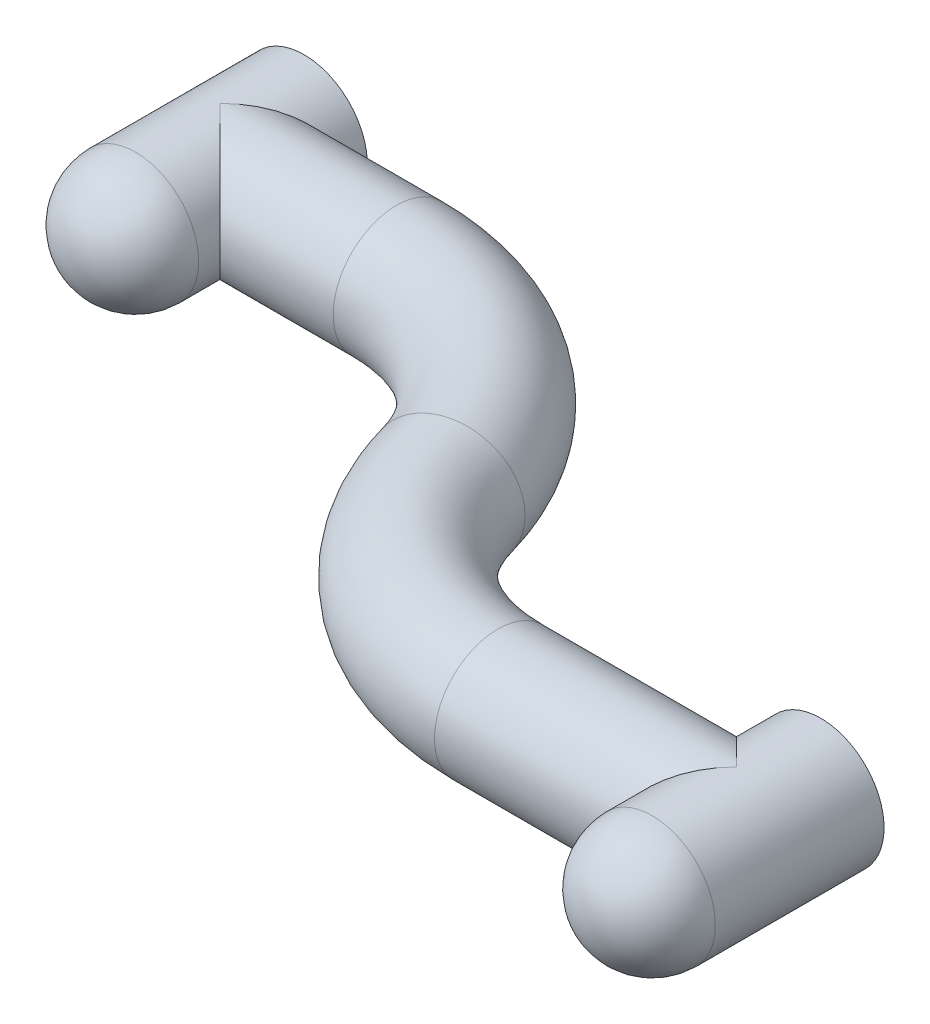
ISO-10303-21;
HEADER;
FILE_DESCRIPTION(('STEP AP214'),'2;1');
FILE_NAME('part.step','',(''),(''),'','','');
FILE_SCHEMA(('AUTOMOTIVE_DESIGN { 1 0 10303 214 1 1 1 1 }'));
ENDSEC;
DATA;
#1=APPLICATION_CONTEXT('core data for automotive mechanical design processes');
#2=APPLICATION_PROTOCOL_DEFINITION('international standard','automotive_design',2000,#1);
#3=PRODUCT_CONTEXT('',#1,'mechanical');
#4=PRODUCT('Part','Part','',(#3));
#5=PRODUCT_RELATED_PRODUCT_CATEGORY('part','',(#4));
#6=PRODUCT_DEFINITION_FORMATION('','',#4);
#7=PRODUCT_DEFINITION_CONTEXT('part definition',#1,'design');
#8=PRODUCT_DEFINITION('design','',#6,#7);
#9=PRODUCT_DEFINITION_SHAPE('','',#8);
#10=(LENGTH_UNIT() NAMED_UNIT(*) SI_UNIT(.MILLI.,.METRE.));
#11=(NAMED_UNIT(*) PLANE_ANGLE_UNIT() SI_UNIT($,.RADIAN.));
#12=(NAMED_UNIT(*) SI_UNIT($,.STERADIAN.) SOLID_ANGLE_UNIT());
#13=UNCERTAINTY_MEASURE_WITH_UNIT(LENGTH_MEASURE(1.E-05),#10,'distance_accuracy_value','');
#14=(GEOMETRIC_REPRESENTATION_CONTEXT(3) GLOBAL_UNCERTAINTY_ASSIGNED_CONTEXT((#13)) GLOBAL_UNIT_ASSIGNED_CONTEXT((#10,
#11,#12)) REPRESENTATION_CONTEXT('',''));
#15=CARTESIAN_POINT('',(0.,0.,0.));
#16=DIRECTION('',(0.,0.,1.));
#17=DIRECTION('',(1.,0.,0.));
#18=AXIS2_PLACEMENT_3D('',#15,#16,#17);
#19=CARTESIAN_POINT('',(-113.203482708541,-4.44089209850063E-13,0.));
#20=DIRECTION('',(1.,0.,0.));
#21=DIRECTION('',(0.,0.,-0.999999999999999));
#22=AXIS2_PLACEMENT_3D('',#19,#20,#21);
#23=CYLINDRICAL_SURFACE('',#22,30.);
#24=CARTESIAN_POINT('',(-113.203482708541,-4.44089209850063E-13,0.));
#25=DIRECTION('',(1.,0.,0.));
#26=DIRECTION('',(0.,0.,-0.999999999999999));
#27=AXIS2_PLACEMENT_3D('',#24,#25,#26);
#28=CIRCLE('',#27,30.);
#29=CARTESIAN_POINT('',(-113.203482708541,-4.44089209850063E-13,-30.));
#30=VERTEX_POINT('',#29);
#31=EDGE_CURVE('E106',#30,#30,#28,.T.);
#32=ORIENTED_EDGE('',*,*,#31,.T.);
#33=EDGE_LOOP('',(#32));
#34=FACE_BOUND('',#33,.T.);
#35=CARTESIAN_POINT('',(0.,0.,0.));
#36=DIRECTION('',(0.707106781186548,0.,0.707106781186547));
#37=DIRECTION('',(0.707106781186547,0.,-0.707106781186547));
#38=AXIS2_PLACEMENT_3D('',#35,#36,#37);
#39=ELLIPSE('',#38,42.4264068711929,30.);
#40=CARTESIAN_POINT('',(1.66533453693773E-13,-30.0000000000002,0.));
#41=VERTEX_POINT('',#40);
#42=CARTESIAN_POINT('',(2.22044604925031E-13,30.0000000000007,0.));
#43=VERTEX_POINT('',#42);
#44=EDGE_CURVE('E72',#41,#43,#39,.F.);
#45=ORIENTED_EDGE('',*,*,#44,.T.);
#46=CARTESIAN_POINT('',(0.,0.,0.));
#47=DIRECTION('',(0.707106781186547,0.,-0.707106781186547));
#48=DIRECTION('',(0.707106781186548,0.,0.707106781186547));
#49=AXIS2_PLACEMENT_3D('',#46,#47,#48);
#50=ELLIPSE('',#49,42.4264068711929,30.);
#51=EDGE_CURVE('E59',#43,#41,#50,.F.);
#52=ORIENTED_EDGE('',*,*,#51,.T.);
#53=EDGE_LOOP('',(#45,#52));
#54=FACE_BOUND('',#53,.T.);
#55=ADVANCED_FACE('F35',(#34,#54),#23,.T.);
#56=CARTESIAN_POINT('',(-311.22362176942,0.,-150.));
#57=DIRECTION('',(-1.,0.,0.));
#58=DIRECTION('',(0.,0.,0.999999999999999));
#59=AXIS2_PLACEMENT_3D('',#56,#57,#58);
#60=CYLINDRICAL_SURFACE('',#59,30.);
#61=CARTESIAN_POINT('',(-311.22362176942,0.,-150.));
#62=DIRECTION('',(1.,0.,0.));
#63=DIRECTION('',(0.,0.,-0.999999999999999));
#64=AXIS2_PLACEMENT_3D('',#61,#62,#63);
#65=CIRCLE('',#64,30.);
#66=CARTESIAN_POINT('',(-311.22362176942,0.,-180.));
#67=VERTEX_POINT('',#66);
#68=EDGE_CURVE('E39',#67,#67,#65,.T.);
#69=ORIENTED_EDGE('',*,*,#68,.F.);
#70=EDGE_LOOP('',(#69));
#71=FACE_BOUND('',#70,.T.);
#72=CARTESIAN_POINT('',(-395.,2.22044604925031E-13,-150.));
#73=DIRECTION('',(-0.707106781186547,0.,0.707106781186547));
#74=DIRECTION('',(-0.707106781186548,0.,-0.707106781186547));
#75=AXIS2_PLACEMENT_3D('',#72,#73,#74);
#76=ELLIPSE('',#75,42.4264068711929,30.);
#77=CARTESIAN_POINT('',(-395.,30.,-150.));
#78=VERTEX_POINT('',#77);
#79=CARTESIAN_POINT('',(-395.,-30.,-150.));
#80=VERTEX_POINT('',#79);
#81=EDGE_CURVE('E64',#78,#80,#76,.F.);
#82=ORIENTED_EDGE('',*,*,#81,.T.);
#83=CARTESIAN_POINT('',(-395.,2.22044604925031E-13,-150.));
#84=DIRECTION('',(-0.707106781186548,0.,-0.707106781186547));
#85=DIRECTION('',(-0.707106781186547,0.,0.707106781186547));
#86=AXIS2_PLACEMENT_3D('',#83,#84,#85);
#87=ELLIPSE('',#86,42.4264068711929,30.);
#88=EDGE_CURVE('E52',#80,#78,#87,.F.);
#89=ORIENTED_EDGE('',*,*,#88,.T.);
#90=EDGE_LOOP('',(#82,#89));
#91=FACE_BOUND('',#90,.T.);
#92=ADVANCED_FACE('F37',(#71,#91),#60,.T.);
#93=CARTESIAN_POINT('',(-311.22362176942,-2.22044604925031E-13,-47.1467075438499));
#94=DIRECTION('',(0.,1.,0.));
#95=DIRECTION('',(0.,0.,0.999999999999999));
#96=AXIS2_PLACEMENT_3D('',#93,#94,#95);
#97=TOROIDAL_SURFACE('',#96,102.85329245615,30.);
#98=CARTESIAN_POINT('',(-212.21355223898,2.22044604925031E-13,-74.9999999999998));
#99=DIRECTION('',(0.270806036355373,0.,0.962633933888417));
#100=DIRECTION('',(0.962633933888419,0.,-0.270806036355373));
#101=AXIS2_PLACEMENT_3D('',#98,#99,#100);
#102=CIRCLE('',#101,30.);
#103=CARTESIAN_POINT('',(-183.334534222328,3.51575473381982E-13,-83.124181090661));
#104=VERTEX_POINT('',#103);
#105=EDGE_CURVE('E309',#104,#104,#102,.T.);
#106=CARTESIAN_POINT('',(-311.22362176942,-2.22044604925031E-13,-47.1467075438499));
#107=DIRECTION('',(0.,1.,0.));
#108=DIRECTION('',(0.,0.,0.999999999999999));
#109=AXIS2_PLACEMENT_3D('',#106,#107,#108);
#110=CIRCLE('',#109,132.85329245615);
#111=EDGE_CURVE('',#104,#67,#110,.T.);
#112=ORIENTED_EDGE('',*,*,#105,.F.);
#113=ORIENTED_EDGE('',*,*,#68,.T.);
#114=ORIENTED_EDGE('',*,*,#111,.T.);
#115=ORIENTED_EDGE('',*,*,#111,.F.);
#116=EDGE_LOOP('',(#112,#114,#113,#115));
#117=FACE_BOUND('',#116,.T.);
#118=ADVANCED_FACE('F101',(#117),#97,.T.);
#119=CARTESIAN_POINT('',(-113.203482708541,-4.44089209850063E-13,-102.85329245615));
#120=DIRECTION('',(0.,-1.,0.));
#121=DIRECTION('',(0.,0.,-0.999999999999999));
#122=AXIS2_PLACEMENT_3D('',#119,#120,#121);
#123=TOROIDAL_SURFACE('',#122,102.85329245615,30.);
#124=ORIENTED_EDGE('',*,*,#31,.F.);
#125=EDGE_LOOP('',(#124));
#126=FACE_BOUND('',#125,.T.);
#127=ORIENTED_EDGE('',*,*,#105,.T.);
#128=EDGE_LOOP('',(#127));
#129=FACE_BOUND('',#128,.T.);
#130=ADVANCED_FACE('F281',(#126,#129),#123,.T.);
#131=CARTESIAN_POINT('',(0.,0.,-39.9999999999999));
#132=DIRECTION('',(0.,0.,0.999999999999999));
#133=DIRECTION('',(1.,0.,0.));
#134=AXIS2_PLACEMENT_3D('',#131,#132,#133);
#135=PLANE('',#134);
#136=CARTESIAN_POINT('',(0.,0.,-39.9999999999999));
#137=DIRECTION('',(0.,0.,0.999999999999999));
#138=DIRECTION('',(1.,0.,0.));
#139=AXIS2_PLACEMENT_3D('',#136,#137,#138);
#140=CIRCLE('',#139,27.);
#141=CARTESIAN_POINT('',(27.0000000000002,0.,-39.9999999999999));
#142=VERTEX_POINT('',#141);
#143=EDGE_CURVE('E127',#142,#142,#140,.T.);
#144=ORIENTED_EDGE('',*,*,#143,.T.);
#145=EDGE_LOOP('',(#144));
#146=FACE_BOUND('',#145,.T.);
#147=CARTESIAN_POINT('',(0.,0.,-39.9999999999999));
#148=DIRECTION('',(0.,0.,-0.999999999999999));
#149=DIRECTION('',(-1.,0.,0.));
#150=AXIS2_PLACEMENT_3D('',#147,#148,#149);
#151=CIRCLE('',#150,30.);
#152=CARTESIAN_POINT('',(-29.9999999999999,0.,-39.9999999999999));
#153=VERTEX_POINT('',#152);
#154=EDGE_CURVE('E69',#153,#153,#151,.T.);
#155=ORIENTED_EDGE('',*,*,#154,.T.);
#156=EDGE_LOOP('',(#155));
#157=FACE_BOUND('',#156,.T.);
#158=ADVANCED_FACE('F93',(#146,#157),#135,.F.);
#159=CARTESIAN_POINT('',(0.,0.,-39.9999999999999));
#160=DIRECTION('',(0.,0.,-0.999999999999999));
#161=DIRECTION('',(-1.,0.,0.));
#162=AXIS2_PLACEMENT_3D('',#159,#160,#161);
#163=CYLINDRICAL_SURFACE('',#162,30.);
#164=ORIENTED_EDGE('',*,*,#51,.F.);
#165=ORIENTED_EDGE('',*,*,#44,.F.);
#166=EDGE_LOOP('',(#164,#165));
#167=FACE_BOUND('',#166,.T.);
#168=ORIENTED_EDGE('',*,*,#154,.F.);
#169=EDGE_LOOP('',(#168));
#170=FACE_BOUND('',#169,.T.);
#171=CARTESIAN_POINT('',(0.,0.,39.9999999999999));
#172=DIRECTION('',(0.,0.,-0.999999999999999));
#173=DIRECTION('',(-1.,0.,0.));
#174=AXIS2_PLACEMENT_3D('',#171,#172,#173);
#175=CIRCLE('',#174,30.);
#176=CARTESIAN_POINT('',(-30.,0.,39.9999999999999));
#177=VERTEX_POINT('',#176);
#178=EDGE_CURVE('E112',#177,#177,#175,.T.);
#179=ORIENTED_EDGE('',*,*,#178,.T.);
#180=EDGE_LOOP('',(#179));
#181=FACE_BOUND('',#180,.T.);
#182=ADVANCED_FACE('F89',(#167,#170,#181),#163,.T.);
#183=CARTESIAN_POINT('',(-395.,-2.22044604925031E-13,-190.));
#184=DIRECTION('',(0.,0.,-0.999999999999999));
#185=DIRECTION('',(-1.,0.,0.));
#186=AXIS2_PLACEMENT_3D('',#183,#184,#185);
#187=CYLINDRICAL_SURFACE('',#186,30.);
#188=CARTESIAN_POINT('',(-395.,2.22044604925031E-13,-110.));
#189=DIRECTION('',(0.,0.,-0.999999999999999));
#190=DIRECTION('',(-1.,0.,0.));
#191=AXIS2_PLACEMENT_3D('',#188,#189,#190);
#192=CIRCLE('',#191,30.);
#193=CARTESIAN_POINT('',(-425.,2.228772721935E-13,-110.));
#194=VERTEX_POINT('',#193);
#195=EDGE_CURVE('E121',#194,#194,#192,.T.);
#196=ORIENTED_EDGE('',*,*,#195,.T.);
#197=EDGE_LOOP('',(#196));
#198=FACE_BOUND('',#197,.T.);
#199=CARTESIAN_POINT('',(-395.,-2.22044604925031E-13,-190.));
#200=DIRECTION('',(0.,0.,-0.999999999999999));
#201=DIRECTION('',(-1.,0.,0.));
#202=AXIS2_PLACEMENT_3D('',#199,#200,#201);
#203=CIRCLE('',#202,30.);
#204=CARTESIAN_POINT('',(-425.,-2.21211937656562E-13,-190.));
#205=VERTEX_POINT('',#204);
#206=EDGE_CURVE('E67',#205,#205,#203,.T.);
#207=ORIENTED_EDGE('',*,*,#206,.F.);
#208=EDGE_LOOP('',(#207));
#209=FACE_BOUND('',#208,.T.);
#210=ORIENTED_EDGE('',*,*,#88,.F.);
#211=ORIENTED_EDGE('',*,*,#81,.F.);
#212=EDGE_LOOP('',(#210,#211));
#213=FACE_BOUND('',#212,.T.);
#214=ADVANCED_FACE('F65',(#198,#209,#213),#187,.T.);
#215=CARTESIAN_POINT('',(-395.,-2.22044604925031E-13,-190.));
#216=DIRECTION('',(0.,0.,-0.999999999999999));
#217=DIRECTION('',(-1.,0.,0.));
#218=AXIS2_PLACEMENT_3D('',#215,#216,#217);
#219=PLANE('',#218);
#220=CARTESIAN_POINT('',(-395.,-2.22044604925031E-13,-190.));
#221=DIRECTION('',(0.,0.,0.999999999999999));
#222=DIRECTION('',(1.,0.,0.));
#223=AXIS2_PLACEMENT_3D('',#220,#221,#222);
#224=CIRCLE('',#223,27.);
#225=CARTESIAN_POINT('',(-368.,-2.22794005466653E-13,-190.));
#226=VERTEX_POINT('',#225);
#227=EDGE_CURVE('E118',#226,#226,#224,.T.);
#228=ORIENTED_EDGE('',*,*,#227,.T.);
#229=EDGE_LOOP('',(#228));
#230=FACE_BOUND('',#229,.T.);
#231=ORIENTED_EDGE('',*,*,#206,.T.);
#232=EDGE_LOOP('',(#231));
#233=FACE_BOUND('',#232,.T.);
#234=ADVANCED_FACE('F142',(#230,#233),#219,.T.);
#235=CARTESIAN_POINT('',(1.66533453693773E-13,0.,-190.));
#236=DIRECTION('',(0.,0.,0.999999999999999));
#237=DIRECTION('',(1.,0.,0.));
#238=AXIS2_PLACEMENT_3D('',#235,#236,#237);
#239=CYLINDRICAL_SURFACE('',#238,27.);
#240=CARTESIAN_POINT('',(0.,0.,39.9999999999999));
#241=DIRECTION('',(0.,0.,-0.999999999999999));
#242=DIRECTION('',(-1.,0.,0.));
#243=AXIS2_PLACEMENT_3D('',#240,#241,#242);
#244=CIRCLE('',#243,27.);
#245=CARTESIAN_POINT('',(27.0000000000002,0.,39.9999999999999));
#246=VERTEX_POINT('',#245);
#247=EDGE_CURVE('E114',#246,#246,#244,.F.);
#248=CARTESIAN_POINT('',(27.0000000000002,0.,39.9999999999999));
#249=CARTESIAN_POINT('',(27.0000000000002,0.,39.1666666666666));
#250=CARTESIAN_POINT('',(27.0000000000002,0.,38.3333333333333));
#251=CARTESIAN_POINT('',(27.0000000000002,0.,36.6666666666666));
#252=CARTESIAN_POINT('',(27.0000000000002,0.,35.8333333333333));
#253=CARTESIAN_POINT('',(27.0000000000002,0.,34.1666666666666));
#254=CARTESIAN_POINT('',(27.0000000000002,0.,33.3333333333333));
#255=CARTESIAN_POINT('',(27.0000000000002,0.,31.6666666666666));
#256=CARTESIAN_POINT('',(27.0000000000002,0.,30.8333333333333));
#257=CARTESIAN_POINT('',(27.0000000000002,0.,29.1666666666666));
#258=CARTESIAN_POINT('',(27.0000000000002,0.,28.3333333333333));
#259=CARTESIAN_POINT('',(27.0000000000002,0.,26.6666666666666));
#260=CARTESIAN_POINT('',(27.0000000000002,0.,25.8333333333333));
#261=CARTESIAN_POINT('',(27.0000000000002,0.,24.1666666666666));
#262=CARTESIAN_POINT('',(27.0000000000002,0.,23.3333333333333));
#263=CARTESIAN_POINT('',(27.0000000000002,0.,21.6666666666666));
#264=CARTESIAN_POINT('',(27.0000000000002,0.,20.8333333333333));
#265=CARTESIAN_POINT('',(27.0000000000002,0.,19.1666666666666));
#266=CARTESIAN_POINT('',(27.0000000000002,0.,18.3333333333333));
#267=CARTESIAN_POINT('',(27.0000000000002,0.,16.6666666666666));
#268=CARTESIAN_POINT('',(27.0000000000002,0.,15.8333333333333));
#269=CARTESIAN_POINT('',(27.0000000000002,0.,14.1666666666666));
#270=CARTESIAN_POINT('',(27.0000000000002,0.,13.3333333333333));
#271=CARTESIAN_POINT('',(27.0000000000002,0.,11.6666666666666));
#272=CARTESIAN_POINT('',(27.0000000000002,0.,10.8333333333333));
#273=CARTESIAN_POINT('',(27.0000000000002,0.,9.16666666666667));
#274=CARTESIAN_POINT('',(27.0000000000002,0.,8.33333333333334));
#275=CARTESIAN_POINT('',(27.0000000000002,0.,6.66666666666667));
#276=CARTESIAN_POINT('',(27.0000000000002,0.,5.83333333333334));
#277=CARTESIAN_POINT('',(27.0000000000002,0.,4.16666666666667));
#278=CARTESIAN_POINT('',(27.0000000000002,0.,3.33333333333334));
#279=CARTESIAN_POINT('',(27.0000000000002,0.,1.66666666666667));
#280=CARTESIAN_POINT('',(27.0000000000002,0.,0.833333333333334));
#281=CARTESIAN_POINT('',(27.0000000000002,0.,-0.833333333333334));
#282=CARTESIAN_POINT('',(27.0000000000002,0.,-1.66666666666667));
#283=CARTESIAN_POINT('',(27.0000000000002,0.,-3.33333333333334));
#284=CARTESIAN_POINT('',(27.0000000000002,0.,-4.16666666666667));
#285=CARTESIAN_POINT('',(27.0000000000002,0.,-5.83333333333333));
#286=CARTESIAN_POINT('',(27.0000000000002,0.,-6.66666666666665));
#287=CARTESIAN_POINT('',(27.0000000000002,0.,-8.33333333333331));
#288=CARTESIAN_POINT('',(27.0000000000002,0.,-9.16666666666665));
#289=CARTESIAN_POINT('',(27.0000000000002,0.,-10.8333333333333));
#290=CARTESIAN_POINT('',(27.0000000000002,0.,-11.6666666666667));
#291=CARTESIAN_POINT('',(27.0000000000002,0.,-13.3333333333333));
#292=CARTESIAN_POINT('',(27.0000000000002,0.,-14.1666666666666));
#293=CARTESIAN_POINT('',(27.0000000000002,0.,-15.8333333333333));
#294=CARTESIAN_POINT('',(27.0000000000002,0.,-16.6666666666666));
#295=CARTESIAN_POINT('',(27.0000000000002,0.,-18.3333333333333));
#296=CARTESIAN_POINT('',(27.0000000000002,0.,-19.1666666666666));
#297=CARTESIAN_POINT('',(27.0000000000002,0.,-20.8333333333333));
#298=CARTESIAN_POINT('',(27.0000000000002,0.,-21.6666666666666));
#299=CARTESIAN_POINT('',(27.0000000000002,0.,-23.3333333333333));
#300=CARTESIAN_POINT('',(27.0000000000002,0.,-24.1666666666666));
#301=CARTESIAN_POINT('',(27.0000000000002,0.,-25.8333333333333));
#302=CARTESIAN_POINT('',(27.0000000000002,0.,-26.6666666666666));
#303=CARTESIAN_POINT('',(27.0000000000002,0.,-28.3333333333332));
#304=CARTESIAN_POINT('',(27.0000000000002,0.,-29.1666666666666));
#305=CARTESIAN_POINT('',(27.0000000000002,0.,-30.8333333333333));
#306=CARTESIAN_POINT('',(27.0000000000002,0.,-31.6666666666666));
#307=CARTESIAN_POINT('',(27.0000000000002,0.,-33.3333333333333));
#308=CARTESIAN_POINT('',(27.0000000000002,0.,-34.1666666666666));
#309=CARTESIAN_POINT('',(27.0000000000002,0.,-35.8333333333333));
#310=CARTESIAN_POINT('',(27.0000000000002,0.,-36.6666666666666));
#311=CARTESIAN_POINT('',(27.0000000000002,0.,-38.3333333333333));
#312=CARTESIAN_POINT('',(27.0000000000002,0.,-39.1666666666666));
#313=CARTESIAN_POINT('',(27.0000000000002,0.,-39.9999999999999));
#314=B_SPLINE_CURVE_WITH_KNOTS('',3,(#248,#249,#250,#251,#252,#253,#254,#255,#256,#257,#258,
#259,#260,#261,#262,#263,#264,#265,#266,#267,#268,#269,#270,#271,#272,#273,#274,#275,#276,#277,
#278,#279,#280,#281,#282,#283,#284,#285,#286,#287,#288,#289,#290,#291,#292,#293,#294,#295,#296,
#297,#298,#299,#300,#301,#302,#303,#304,#305,#306,#307,#308,#309,#310,#311,#312,#313),
.UNSPECIFIED.,.F.,.F.,(4,2,2,2,2,2,2,2,2,2,2,2,2,2,2,2,2,2,2,2,2,2,2,2,2,2,2,2,2,2,2,2,4),(0.,
2.5,5.,7.50000000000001,9.99999999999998,12.5,15.,17.5,20.,22.5,25.,27.5,29.9999999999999,
32.4999999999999,34.9999999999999,37.4999999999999,39.9999999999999,42.4999999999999,
44.9999999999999,47.4999999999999,49.9999999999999,52.4999999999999,54.9999999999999,
57.4999999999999,59.9999999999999,62.4999999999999,64.9999999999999,67.4999999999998,
69.9999999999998,72.4999999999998,74.9999999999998,77.4999999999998,79.9999999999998),.UNSPECIFIED.);
#315=EDGE_CURVE('BSEAM145',#246,#142,#314,.T.);
#316=ORIENTED_EDGE('',*,*,#247,.T.);
#317=ORIENTED_EDGE('',*,*,#143,.F.);
#318=ORIENTED_EDGE('',*,*,#315,.T.);
#319=ORIENTED_EDGE('',*,*,#315,.F.);
#320=EDGE_LOOP('',(#316,#318,#317,#319));
#321=FACE_BOUND('',#320,.T.);
#322=ADVANCED_FACE('F145',(#321),#239,.F.);
#323=CARTESIAN_POINT('',(-395.,-2.22044604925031E-13,-190.));
#324=DIRECTION('',(0.,0.,0.999999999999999));
#325=DIRECTION('',(1.,0.,0.));
#326=AXIS2_PLACEMENT_3D('',#323,#324,#325);
#327=CYLINDRICAL_SURFACE('',#326,27.);
#328=CARTESIAN_POINT('',(-395.,2.22044604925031E-13,-110.));
#329=DIRECTION('',(0.,0.,-0.999999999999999));
#330=DIRECTION('',(-1.,0.,0.));
#331=AXIS2_PLACEMENT_3D('',#328,#329,#330);
#332=CIRCLE('',#331,27.);
#333=CARTESIAN_POINT('',(-368.,-2.22794005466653E-13,-110.));
#334=VERTEX_POINT('',#333);
#335=EDGE_CURVE('E115',#334,#334,#332,.F.);
#336=CARTESIAN_POINT('',(-368.,-2.22794005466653E-13,-110.));
#337=CARTESIAN_POINT('',(-368.,-2.22794005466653E-13,-110.833333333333));
#338=CARTESIAN_POINT('',(-368.,-2.22794005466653E-13,-111.666666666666));
#339=CARTESIAN_POINT('',(-368.,-2.22794005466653E-13,-113.333333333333));
#340=CARTESIAN_POINT('',(-368.,-2.22794005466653E-13,-114.166666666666));
#341=CARTESIAN_POINT('',(-368.,-2.22794005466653E-13,-115.833333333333));
#342=CARTESIAN_POINT('',(-368.,-2.22794005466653E-13,-116.666666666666));
#343=CARTESIAN_POINT('',(-368.,-2.22794005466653E-13,-118.333333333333));
#344=CARTESIAN_POINT('',(-368.,-2.22794005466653E-13,-119.166666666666));
#345=CARTESIAN_POINT('',(-368.,-2.22794005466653E-13,-120.833333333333));
#346=CARTESIAN_POINT('',(-368.,-2.22794005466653E-13,-121.666666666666));
#347=CARTESIAN_POINT('',(-368.,-2.22794005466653E-13,-123.333333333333));
#348=CARTESIAN_POINT('',(-368.,-2.22794005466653E-13,-124.166666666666));
#349=CARTESIAN_POINT('',(-368.,-2.22794005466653E-13,-125.833333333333));
#350=CARTESIAN_POINT('',(-368.,-2.22794005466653E-13,-126.666666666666));
#351=CARTESIAN_POINT('',(-368.,-2.22794005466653E-13,-128.333333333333));
#352=CARTESIAN_POINT('',(-368.,-2.22794005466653E-13,-129.166666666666));
#353=CARTESIAN_POINT('',(-368.,-2.22794005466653E-13,-130.833333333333));
#354=CARTESIAN_POINT('',(-368.,-2.22794005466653E-13,-131.666666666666));
#355=CARTESIAN_POINT('',(-368.,-2.22794005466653E-13,-133.333333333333));
#356=CARTESIAN_POINT('',(-368.,-2.22794005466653E-13,-134.166666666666));
#357=CARTESIAN_POINT('',(-368.,-2.22794005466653E-13,-135.833333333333));
#358=CARTESIAN_POINT('',(-368.,-2.22794005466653E-13,-136.666666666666));
#359=CARTESIAN_POINT('',(-368.,-2.22794005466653E-13,-138.333333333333));
#360=CARTESIAN_POINT('',(-368.,-2.22794005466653E-13,-139.166666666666));
#361=CARTESIAN_POINT('',(-368.,-2.22794005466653E-13,-140.833333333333));
#362=CARTESIAN_POINT('',(-368.,-2.22794005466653E-13,-141.666666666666));
#363=CARTESIAN_POINT('',(-368.,-2.22794005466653E-13,-143.333333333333));
#364=CARTESIAN_POINT('',(-368.,-2.22794005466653E-13,-144.166666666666));
#365=CARTESIAN_POINT('',(-368.,-2.22794005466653E-13,-145.833333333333));
#366=CARTESIAN_POINT('',(-368.,-2.22794005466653E-13,-146.666666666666));
#367=CARTESIAN_POINT('',(-368.,-2.22794005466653E-13,-148.333333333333));
#368=CARTESIAN_POINT('',(-368.,-2.22794005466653E-13,-149.166666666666));
#369=CARTESIAN_POINT('',(-368.,-2.22794005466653E-13,-150.833333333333));
#370=CARTESIAN_POINT('',(-368.,-2.22794005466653E-13,-151.666666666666));
#371=CARTESIAN_POINT('',(-368.,-2.22794005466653E-13,-153.333333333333));
#372=CARTESIAN_POINT('',(-368.,-2.22794005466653E-13,-154.166666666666));
#373=CARTESIAN_POINT('',(-368.,-2.22794005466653E-13,-155.833333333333));
#374=CARTESIAN_POINT('',(-368.,-2.22794005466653E-13,-156.666666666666));
#375=CARTESIAN_POINT('',(-368.,-2.22794005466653E-13,-158.333333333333));
#376=CARTESIAN_POINT('',(-368.,-2.22794005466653E-13,-159.166666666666));
#377=CARTESIAN_POINT('',(-368.,-2.22794005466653E-13,-160.833333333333));
#378=CARTESIAN_POINT('',(-368.,-2.22794005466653E-13,-161.666666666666));
#379=CARTESIAN_POINT('',(-368.,-2.22794005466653E-13,-163.333333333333));
#380=CARTESIAN_POINT('',(-368.,-2.22794005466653E-13,-164.166666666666));
#381=CARTESIAN_POINT('',(-368.,-2.22794005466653E-13,-165.833333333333));
#382=CARTESIAN_POINT('',(-368.,-2.22794005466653E-13,-166.666666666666));
#383=CARTESIAN_POINT('',(-368.,-2.22794005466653E-13,-168.333333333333));
#384=CARTESIAN_POINT('',(-368.,-2.22794005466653E-13,-169.166666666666));
#385=CARTESIAN_POINT('',(-368.,-2.22794005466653E-13,-170.833333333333));
#386=CARTESIAN_POINT('',(-368.,-2.22794005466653E-13,-171.666666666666));
#387=CARTESIAN_POINT('',(-368.,-2.22794005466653E-13,-173.333333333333));
#388=CARTESIAN_POINT('',(-368.,-2.22794005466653E-13,-174.166666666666));
#389=CARTESIAN_POINT('',(-368.,-2.22794005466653E-13,-175.833333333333));
#390=CARTESIAN_POINT('',(-368.,-2.22794005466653E-13,-176.666666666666));
#391=CARTESIAN_POINT('',(-368.,-2.22794005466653E-13,-178.333333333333));
#392=CARTESIAN_POINT('',(-368.,-2.22794005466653E-13,-179.166666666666));
#393=CARTESIAN_POINT('',(-368.,-2.22794005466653E-13,-180.833333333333));
#394=CARTESIAN_POINT('',(-368.,-2.22794005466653E-13,-181.666666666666));
#395=CARTESIAN_POINT('',(-368.,-2.22794005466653E-13,-183.333333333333));
#396=CARTESIAN_POINT('',(-368.,-2.22794005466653E-13,-184.166666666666));
#397=CARTESIAN_POINT('',(-368.,-2.22794005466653E-13,-185.833333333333));
#398=CARTESIAN_POINT('',(-368.,-2.22794005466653E-13,-186.666666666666));
#399=CARTESIAN_POINT('',(-368.,-2.22794005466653E-13,-188.333333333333));
#400=CARTESIAN_POINT('',(-368.,-2.22794005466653E-13,-189.166666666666));
#401=CARTESIAN_POINT('',(-368.,-2.22794005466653E-13,-190.));
#402=B_SPLINE_CURVE_WITH_KNOTS('',3,(#336,#337,#338,#339,#340,#341,#342,#343,#344,#345,#346,
#347,#348,#349,#350,#351,#352,#353,#354,#355,#356,#357,#358,#359,#360,#361,#362,#363,#364,#365,
#366,#367,#368,#369,#370,#371,#372,#373,#374,#375,#376,#377,#378,#379,#380,#381,#382,#383,#384,
#385,#386,#387,#388,#389,#390,#391,#392,#393,#394,#395,#396,#397,#398,#399,#400,#401),
.UNSPECIFIED.,.F.,.F.,(4,2,2,2,2,2,2,2,2,2,2,2,2,2,2,2,2,2,2,2,2,2,2,2,2,2,2,2,2,2,2,2,4),(0.,
2.5,4.99999999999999,7.49999999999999,9.99999999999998,12.5,15.,17.5,19.9999999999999,
22.4999999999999,24.9999999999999,27.4999999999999,29.9999999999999,32.4999999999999,
34.9999999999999,37.4999999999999,39.9999999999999,42.4999999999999,44.9999999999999,
47.4999999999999,49.9999999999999,52.4999999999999,54.9999999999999,57.4999999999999,
59.9999999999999,62.4999999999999,64.9999999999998,67.4999999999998,69.9999999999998,
72.4999999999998,74.9999999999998,77.4999999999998,79.9999999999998),.UNSPECIFIED.);
#403=EDGE_CURVE('BSEAM149',#334,#226,#402,.T.);
#404=ORIENTED_EDGE('',*,*,#335,.T.);
#405=ORIENTED_EDGE('',*,*,#227,.F.);
#406=ORIENTED_EDGE('',*,*,#403,.T.);
#407=ORIENTED_EDGE('',*,*,#403,.F.);
#408=EDGE_LOOP('',(#404,#406,#405,#407));
#409=FACE_BOUND('',#408,.T.);
#410=ADVANCED_FACE('F149',(#409),#327,.F.);
#411=CARTESIAN_POINT('',(-30.,-4.44089209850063E-13,40.));
#412=DIRECTION('',(0.,0.,-0.999999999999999));
#413=DIRECTION('',(-1.,0.,0.));
#414=AXIS2_PLACEMENT_3D('',#411,#412,#413);
#415=PLANE('',#414);
#416=ORIENTED_EDGE('',*,*,#247,.F.);
#417=EDGE_LOOP('',(#416));
#418=FACE_BOUND('',#417,.T.);
#419=ADVANCED_FACE('F153',(#418),#415,.T.);
#420=CARTESIAN_POINT('',(0.,0.,39.9999999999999));
#421=DIRECTION('',(0.,0.,-0.999999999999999));
#422=DIRECTION('',(-1.,0.,0.));
#423=AXIS2_PLACEMENT_3D('',#420,#421,#422);
#424=SPHERICAL_SURFACE('',#423,30.);
#425=ORIENTED_EDGE('',*,*,#178,.F.);
#426=EDGE_LOOP('',(#425));
#427=FACE_BOUND('',#426,.T.);
#428=ADVANCED_FACE('F155',(#427),#424,.T.);
#429=CARTESIAN_POINT('',(-425.,-4.44089209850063E-13,-110.));
#430=DIRECTION('',(0.,0.,-0.999999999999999));
#431=DIRECTION('',(-1.,0.,0.));
#432=AXIS2_PLACEMENT_3D('',#429,#430,#431);
#433=PLANE('',#432);
#434=ORIENTED_EDGE('',*,*,#335,.F.);
#435=EDGE_LOOP('',(#434));
#436=FACE_BOUND('',#435,.T.);
#437=ADVANCED_FACE('F158',(#436),#433,.T.);
#438=CARTESIAN_POINT('',(-395.,2.22044604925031E-13,-110.));
#439=DIRECTION('',(0.,0.,-0.999999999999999));
#440=DIRECTION('',(-1.,0.,0.));
#441=AXIS2_PLACEMENT_3D('',#438,#439,#440);
#442=SPHERICAL_SURFACE('',#441,30.);
#443=ORIENTED_EDGE('',*,*,#195,.F.);
#444=EDGE_LOOP('',(#443));
#445=FACE_BOUND('',#444,.T.);
#446=ADVANCED_FACE('F162',(#445),#442,.T.);
#447=CLOSED_SHELL('',(#55,#92,#118,#130,#158,#182,#214,#234,#322,#410,#419,#428,#437,#446));
#448=CARTESIAN_POINT('',(-365.,0.,-123.));
#449=CARTESIAN_POINT('',(-365.000005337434,-0.625774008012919,-123.000005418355));
#450=CARTESIAN_POINT('',(-365.019622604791,-1.25163798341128,-123.021797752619));
#451=CARTESIAN_POINT('',(-365.097655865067,-2.49798362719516,-123.108541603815));
#452=CARTESIAN_POINT('',(-365.15607939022,-3.11846422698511,-123.173501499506));
#453=CARTESIAN_POINT('',(-365.3104697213,-4.34934840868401,-123.345363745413));
#454=CARTESIAN_POINT('',(-365.406467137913,-4.95974335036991,-123.45230029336));
#455=CARTESIAN_POINT('',(-365.633950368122,-6.16534685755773,-123.706121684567));
#456=CARTESIAN_POINT('',(-365.765435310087,-6.76055579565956,-123.853005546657));
#457=CARTESIAN_POINT('',(-366.060337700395,-7.92819257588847,-124.183154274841));
#458=CARTESIAN_POINT('',(-366.223542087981,-8.5007433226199,-124.366176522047));
#459=CARTESIAN_POINT('',(-366.579542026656,-9.62417911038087,-124.766474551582));
#460=CARTESIAN_POINT('',(-366.772337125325,-10.1750644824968,-124.983749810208));
#461=CARTESIAN_POINT('',(-367.184504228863,-11.253056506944,-125.449773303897));
#462=CARTESIAN_POINT('',(-367.403879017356,-11.7801606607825,-125.69852483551));
#463=CARTESIAN_POINT('',(-367.86619841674,-12.8091780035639,-126.224823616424));
#464=CARTESIAN_POINT('',(-368.109148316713,-13.3110855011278,-126.502377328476));
#465=CARTESIAN_POINT('',(-368.539174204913,-14.1411644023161,-126.995973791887));
#466=CARTESIAN_POINT('',(-368.721005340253,-14.4760839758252,-127.205324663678));
#467=CARTESIAN_POINT('',(-369.093648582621,-15.1328615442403,-127.635951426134));
#468=CARTESIAN_POINT('',(-369.284458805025,-15.4547222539,-127.857224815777));
#469=CARTESIAN_POINT('',(-369.869142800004,-16.4009074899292,-128.538074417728));
#470=CARTESIAN_POINT('',(-370.275194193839,-17.0056904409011,-129.014593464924));
#471=CARTESIAN_POINT('',(-371.113055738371,-18.1638668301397,-130.008556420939));
#472=CARTESIAN_POINT('',(-371.544918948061,-18.7171479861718,-130.526085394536));
#473=CARTESIAN_POINT('',(-372.426567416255,-19.7714988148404,-131.597483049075));
#474=CARTESIAN_POINT('',(-372.876350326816,-20.2725752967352,-132.151346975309));
#475=CARTESIAN_POINT('',(-373.797349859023,-21.2344359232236,-133.306384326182));
#476=CARTESIAN_POINT('',(-374.268821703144,-21.6940092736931,-133.908359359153));
#477=CARTESIAN_POINT('',(-375.215045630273,-22.5602898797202,-135.14722262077));
#478=CARTESIAN_POINT('',(-375.689798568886,-22.9669827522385,-135.784120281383));
#479=CARTESIAN_POINT('',(-376.396230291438,-23.5370203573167,-136.765527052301));
#480=CARTESIAN_POINT('',(-376.630573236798,-23.7202356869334,-137.096731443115));
#481=CARTESIAN_POINT('',(-377.09596810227,-24.0734479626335,-137.768356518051));
#482=CARTESIAN_POINT('',(-377.327020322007,-24.2434461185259,-138.1087763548));
#483=CARTESIAN_POINT('',(-377.783941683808,-24.5700256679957,-138.79912603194));
#484=CARTESIAN_POINT('',(-378.009813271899,-24.7266134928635,-139.149051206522));
#485=CARTESIAN_POINT('',(-378.454289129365,-25.0262112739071,-139.85913067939));
#486=CARTESIAN_POINT('',(-378.67289440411,-25.1692231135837,-140.219283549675));
#487=CARTESIAN_POINT('',(-379.099488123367,-25.44086158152,-140.949377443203));
#488=CARTESIAN_POINT('',(-379.307509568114,-25.5695346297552,-141.319281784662));
#489=CARTESIAN_POINT('',(-379.71042346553,-25.8124809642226,-142.070827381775));
#490=CARTESIAN_POINT('',(-379.905316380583,-25.926754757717,-142.452468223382));
#491=CARTESIAN_POINT('',(-380.277774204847,-26.1400476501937,-143.228031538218));
#492=CARTESIAN_POINT('',(-380.455349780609,-26.2390761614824,-143.621946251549));
#493=CARTESIAN_POINT('',(-380.788282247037,-26.4208830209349,-144.422774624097));
#494=CARTESIAN_POINT('',(-380.943642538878,-26.5036638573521,-144.829686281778));
#495=CARTESIAN_POINT('',(-381.202359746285,-26.6391204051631,-145.586497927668));
#496=CARTESIAN_POINT('',(-381.310068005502,-26.6945195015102,-145.934414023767));
#497=CARTESIAN_POINT('',(-381.502362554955,-26.7922645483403,-146.638343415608));
#498=CARTESIAN_POINT('',(-381.586956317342,-26.8346147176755,-146.994354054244));
#499=CARTESIAN_POINT('',(-381.729351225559,-26.9053197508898,-147.712306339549));
#500=CARTESIAN_POINT('',(-381.787211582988,-26.9337055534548,-148.074233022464));
#501=CARTESIAN_POINT('',(-381.873557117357,-26.975893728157,-148.802450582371));
#502=CARTESIAN_POINT('',(-381.902044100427,-26.9896969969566,-149.16874118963));
#503=CARTESIAN_POINT('',(-381.928154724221,-27.0023534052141,-149.904707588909));
#504=CARTESIAN_POINT('',(-381.925608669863,-27.0011243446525,-150.274390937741));
#505=CARTESIAN_POINT('',(-381.889387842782,-26.9835548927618,-151.011846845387));
#506=CARTESIAN_POINT('',(-381.855712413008,-26.9672141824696,-151.379619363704));
#507=CARTESIAN_POINT('',(-381.758985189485,-26.9198512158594,-152.110965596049));
#508=CARTESIAN_POINT('',(-381.695878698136,-26.8888016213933,-152.474530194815));
#509=CARTESIAN_POINT('',(-381.543352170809,-26.8127927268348,-153.194575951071));
#510=CARTESIAN_POINT('',(-381.453927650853,-26.767831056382,-153.551055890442));
#511=CARTESIAN_POINT('',(-381.209249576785,-26.6428459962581,-154.406507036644));
#512=CARTESIAN_POINT('',(-381.042205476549,-26.5560534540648,-154.901115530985));
#513=CARTESIAN_POINT('',(-380.672524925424,-26.3584391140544,-155.871835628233));
#514=CARTESIAN_POINT('',(-380.46986833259,-26.2476037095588,-156.347936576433));
#515=CARTESIAN_POINT('',(-380.037408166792,-26.0035136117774,-157.283671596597));
#516=CARTESIAN_POINT('',(-379.807512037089,-25.870181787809,-157.743242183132));
#517=CARTESIAN_POINT('',(-379.328472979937,-25.5828315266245,-158.645394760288));
#518=CARTESIAN_POINT('',(-379.079331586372,-25.4288147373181,-159.087978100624));
#519=CARTESIAN_POINT('',(-378.586394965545,-25.1132000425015,-159.925331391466));
#520=CARTESIAN_POINT('',(-378.343574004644,-24.9530119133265,-160.321212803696));
#521=CARTESIAN_POINT('',(-377.84965895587,-24.6161569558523,-161.100680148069));
#522=CARTESIAN_POINT('',(-377.59856355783,-24.4394875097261,-161.484264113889));
#523=CARTESIAN_POINT('',(-377.09075150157,-24.0698469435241,-162.240079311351));
#524=CARTESIAN_POINT('',(-376.834031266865,-23.8768652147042,-162.612302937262));
#525=CARTESIAN_POINT('',(-376.317415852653,-23.474841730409,-163.345660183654));
#526=CARTESIAN_POINT('',(-376.057520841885,-23.2658008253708,-163.706794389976));
#527=CARTESIAN_POINT('',(-375.536458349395,-22.8316781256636,-164.41832666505));
#528=CARTESIAN_POINT('',(-375.275290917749,-22.6065969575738,-164.768725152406));
#529=CARTESIAN_POINT('',(-374.753322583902,-22.1403388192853,-165.45893996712));
#530=CARTESIAN_POINT('',(-374.492521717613,-21.8991603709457,-165.798755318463));
#531=CARTESIAN_POINT('',(-373.713173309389,-21.1515661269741,-166.801995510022));
#532=CARTESIAN_POINT('',(-373.197330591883,-20.6208039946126,-167.449685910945));
#533=CARTESIAN_POINT('',(-372.25641569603,-19.5742568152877,-168.610980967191));
#534=CARTESIAN_POINT('',(-371.828916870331,-19.0671958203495,-169.130510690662));
#535=CARTESIAN_POINT('',(-370.993523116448,-18.0040576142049,-170.134259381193));
#536=CARTESIAN_POINT('',(-370.585629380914,-17.4479774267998,-170.618476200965));
#537=CARTESIAN_POINT('',(-369.796604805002,-16.2874241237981,-171.546944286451));
#538=CARTESIAN_POINT('',(-369.415428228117,-15.6830376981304,-171.991264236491));
#539=CARTESIAN_POINT('',(-368.868433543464,-14.7401931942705,-172.624544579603));
#540=CARTESIAN_POINT('',(-368.690242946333,-14.419893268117,-172.830090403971));
#541=CARTESIAN_POINT('',(-368.34289934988,-13.7671957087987,-173.22952330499));
#542=CARTESIAN_POINT('',(-368.173748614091,-13.4347950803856,-173.423407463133));
#543=CARTESIAN_POINT('',(-367.756635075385,-12.5751623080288,-173.900221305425));
#544=CARTESIAN_POINT('',(-367.515523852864,-12.0397847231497,-174.174599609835));
#545=CARTESIAN_POINT('',(-367.060523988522,-10.9425025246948,-174.690668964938));
#546=CARTESIAN_POINT('',(-366.846628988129,-10.3806041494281,-174.932367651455));
#547=CARTESIAN_POINT('',(-366.449474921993,-9.23235504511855,-175.379975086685));
#548=CARTESIAN_POINT('',(-366.266207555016,-8.64601099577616,-175.585893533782));
#549=CARTESIAN_POINT('',(-365.933576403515,-7.45166043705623,-175.958892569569));
#550=CARTESIAN_POINT('',(-365.784213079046,-6.843653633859,-176.125972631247));
#551=CARTESIAN_POINT('',(-365.521434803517,-5.60516361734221,-176.419502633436));
#552=CARTESIAN_POINT('',(-365.408300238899,-4.97454520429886,-176.545635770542));
#553=CARTESIAN_POINT('',(-365.222089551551,-3.70009505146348,-176.753056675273));
#554=CARTESIAN_POINT('',(-365.149013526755,-3.05626327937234,-176.834344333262));
#555=CARTESIAN_POINT('',(-365.044710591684,-1.76134663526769,-176.950324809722));
#556=CARTESIAN_POINT('',(-365.013463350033,-1.1102654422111,-176.985040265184));
#557=CARTESIAN_POINT('',(-364.99354366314,0.193318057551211,-177.007174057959));
#558=CARTESIAN_POINT('',(-365.004866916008,0.845820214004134,-176.994597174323));
#559=CARTESIAN_POINT('',(-365.065949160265,2.06943823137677,-176.92670746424));
#560=CARTESIAN_POINT('',(-365.111025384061,2.64109041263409,-176.876601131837));
#561=CARTESIAN_POINT('',(-365.233186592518,3.77661597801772,-176.740681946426));
#562=CARTESIAN_POINT('',(-365.310268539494,4.34049009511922,-176.654872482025));
#563=CARTESIAN_POINT('',(-365.49503174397,5.4568322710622,-176.448917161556));
#564=CARTESIAN_POINT('',(-365.602714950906,6.00929960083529,-176.328769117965));
#565=CARTESIAN_POINT('',(-365.846829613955,7.09963507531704,-176.055921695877));
#566=CARTESIAN_POINT('',(-365.983262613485,7.63750243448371,-175.903220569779));
#567=CARTESIAN_POINT('',(-366.286386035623,8.70895637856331,-175.563209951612));
#568=CARTESIAN_POINT('',(-366.453735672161,9.24211548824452,-175.375144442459));
#569=CARTESIAN_POINT('',(-366.813822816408,10.2881195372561,-174.969367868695));
#570=CARTESIAN_POINT('',(-367.006559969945,10.8009647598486,-174.75165721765));
#571=CARTESIAN_POINT('',(-367.414869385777,11.804841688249,-174.288912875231));
#572=CARTESIAN_POINT('',(-367.630446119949,12.2958690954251,-174.043873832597));
#573=CARTESIAN_POINT('',(-368.081878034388,13.2550262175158,-173.528720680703));
#574=CARTESIAN_POINT('',(-368.317737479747,13.7231510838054,-173.258601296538));
#575=CARTESIAN_POINT('',(-368.745851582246,14.5213739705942,-172.766009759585));
#576=CARTESIAN_POINT('',(-368.934230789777,14.856675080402,-172.54854992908));
#577=CARTESIAN_POINT('',(-369.319878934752,15.5137519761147,-172.101614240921));
#578=CARTESIAN_POINT('',(-369.51714635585,15.8355300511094,-171.872140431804));
#579=CARTESIAN_POINT('',(-370.121029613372,16.7808218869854,-171.166543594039));
#580=CARTESIAN_POINT('',(-370.539632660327,17.3841201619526,-170.673352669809));
#581=CARTESIAN_POINT('',(-371.402030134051,18.5379653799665,-169.645424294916));
#582=CARTESIAN_POINT('',(-371.845887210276,19.088371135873,-169.110582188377));
#583=CARTESIAN_POINT('',(-372.750404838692,20.135388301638,-168.004060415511));
#584=CARTESIAN_POINT('',(-373.211062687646,20.6320083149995,-167.432386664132));
#585=CARTESIAN_POINT('',(-374.152341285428,21.5831656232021,-166.24073908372));
#586=CARTESIAN_POINT('',(-374.633177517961,22.0364736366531,-165.619957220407));
#587=CARTESIAN_POINT('',(-375.595817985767,22.888655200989,-164.342232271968));
#588=CARTESIAN_POINT('',(-376.077622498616,23.2875098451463,-163.685276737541));
#589=CARTESIAN_POINT('',(-376.791807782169,23.8443466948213,-162.672602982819));
#590=CARTESIAN_POINT('',(-377.028209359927,24.0228882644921,-162.330872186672));
#591=CARTESIAN_POINT('',(-377.496625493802,24.3662908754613,-161.637593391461));
#592=CARTESIAN_POINT('',(-377.728639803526,24.5311511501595,-161.286044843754));
#593=CARTESIAN_POINT('',(-378.186002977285,24.8468644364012,-160.572856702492));
#594=CARTESIAN_POINT('',(-378.411356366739,24.9977271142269,-160.211224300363));
#595=CARTESIAN_POINT('',(-378.852960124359,25.2852225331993,-159.47696949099));
#596=CARTESIAN_POINT('',(-379.069212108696,25.4218578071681,-159.10434905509));
#597=CARTESIAN_POINT('',(-379.477686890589,25.6731774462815,-158.368426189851));
#598=CARTESIAN_POINT('',(-379.670577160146,25.7886624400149,-158.005769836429));
#599=CARTESIAN_POINT('',(-380.042076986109,26.0058998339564,-157.269154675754));
#600=CARTESIAN_POINT('',(-380.220687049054,26.1076527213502,-156.895196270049));
#601=CARTESIAN_POINT('',(-380.559345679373,26.2964836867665,-156.135785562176));
#602=CARTESIAN_POINT('',(-380.719413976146,26.3835774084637,-155.750346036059));
#603=CARTESIAN_POINT('',(-381.016292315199,26.5421224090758,-154.96741020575));
#604=CARTESIAN_POINT('',(-381.153106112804,26.6135762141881,-154.56991586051));
#605=CARTESIAN_POINT('',(-381.378192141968,26.7293793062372,-153.828502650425));
#606=CARTESIAN_POINT('',(-381.470734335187,26.7762412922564,-153.486280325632));
#607=CARTESIAN_POINT('',(-381.632190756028,26.8572124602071,-152.79485322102));
#608=CARTESIAN_POINT('',(-381.701112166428,26.8913255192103,-152.445650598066));
#609=CARTESIAN_POINT('',(-381.812266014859,26.9460115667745,-151.74256334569));
#610=CARTESIAN_POINT('',(-381.854546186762,26.9666087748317,-151.388688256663));
#611=CARTESIAN_POINT('',(-381.910520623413,26.9938237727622,-150.678125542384));
#612=CARTESIAN_POINT('',(-381.924215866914,27.0004420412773,-150.321438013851));
#613=CARTESIAN_POINT('',(-381.92229330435,26.9995108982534,-149.60726455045));
#614=CARTESIAN_POINT('',(-381.906601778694,26.9919258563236,-149.249778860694));
#615=CARTESIAN_POINT('',(-381.846594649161,26.9627338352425,-148.537824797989));
#616=CARTESIAN_POINT('',(-381.802278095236,26.9411263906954,-148.183356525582));
#617=CARTESIAN_POINT('',(-381.687098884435,26.8843960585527,-147.479232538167));
#618=CARTESIAN_POINT('',(-381.616186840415,26.849248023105,-147.129587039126));
#619=CARTESIAN_POINT('',(-381.450883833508,26.7662098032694,-146.43747567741));
#620=CARTESIAN_POINT('',(-381.356489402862,26.7183177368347,-146.09501088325));
#621=CARTESIAN_POINT('',(-381.090762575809,26.5813078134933,-145.234080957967));
#622=CARTESIAN_POINT('',(-380.905510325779,26.4839359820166,-144.721216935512));
#623=CARTESIAN_POINT('',(-380.498955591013,26.2635324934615,-143.715713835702));
#624=CARTESIAN_POINT('',(-380.27762917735,26.1404837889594,-143.2230884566));
#625=CARTESIAN_POINT('',(-379.807982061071,25.8703741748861,-142.255525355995));
#626=CARTESIAN_POINT('',(-379.559566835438,25.7232282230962,-141.78065787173));
#627=CARTESIAN_POINT('',(-379.044107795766,25.4067116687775,-140.848986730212));
#628=CARTESIAN_POINT('',(-378.777066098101,25.2373435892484,-140.392181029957));
#629=CARTESIAN_POINT('',(-378.255656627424,24.8940791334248,-139.53688222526));
#630=CARTESIAN_POINT('',(-378.002429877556,24.722078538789,-139.13692422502));
#631=CARTESIAN_POINT('',(-377.488736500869,24.3609165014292,-138.34953323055));
#632=CARTESIAN_POINT('',(-377.228268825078,24.17175256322,-137.962102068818));
#633=CARTESIAN_POINT('',(-376.702673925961,23.7763767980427,-137.198878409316));
#634=CARTESIAN_POINT('',(-376.437543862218,23.5701542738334,-136.823093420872));
#635=CARTESIAN_POINT('',(-375.905031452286,23.1408547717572,-136.082965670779));
#636=CARTESIAN_POINT('',(-375.637649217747,22.9177786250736,-135.718622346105));
#637=CARTESIAN_POINT('',(-375.102644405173,22.4548502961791,-135.001272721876));
#638=CARTESIAN_POINT('',(-374.835022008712,22.2150063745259,-134.648260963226));
#639=CARTESIAN_POINT('',(-374.3010699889,21.7183638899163,-133.953347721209));
#640=CARTESIAN_POINT('',(-374.034740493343,21.4615636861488,-133.611447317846));
#641=CARTESIAN_POINT('',(-373.240259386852,20.6657932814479,-132.602917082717));
#642=CARTESIAN_POINT('',(-372.716230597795,20.1011247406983,-131.952948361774));
#643=CARTESIAN_POINT('',(-371.787516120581,19.0155327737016,-130.819186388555));
#644=CARTESIAN_POINT('',(-371.378963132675,18.5064466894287,-130.32717294));
#645=CARTESIAN_POINT('',(-370.582402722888,17.4419834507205,-129.377537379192));
#646=CARTESIAN_POINT('',(-370.194395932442,16.8866048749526,-128.919916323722));
#647=CARTESIAN_POINT('',(-369.445466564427,15.7302090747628,-128.043547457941));
#648=CARTESIAN_POINT('',(-369.084504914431,15.129260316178,-127.624743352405));
#649=CARTESIAN_POINT('',(-368.5678203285,14.1938999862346,-127.028934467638));
#650=CARTESIAN_POINT('',(-368.399729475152,13.8764806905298,-126.835743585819));
#651=CARTESIAN_POINT('',(-368.0725250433,13.2303535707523,-126.460728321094));
#652=CARTESIAN_POINT('',(-367.913413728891,12.9016429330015,-126.278906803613));
#653=CARTESIAN_POINT('',(-367.51734171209,12.0431218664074,-125.827411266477));
#654=CARTESIAN_POINT('',(-367.287570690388,11.5052623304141,-125.566583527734));
#655=CARTESIAN_POINT('',(-366.855692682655,10.4042098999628,-125.077818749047));
#656=CARTESIAN_POINT('',(-366.65357968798,9.84102254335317,-124.84987456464));
#657=CARTESIAN_POINT('',(-366.280456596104,8.69207718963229,-124.430068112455));
#658=CARTESIAN_POINT('',(-366.109412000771,8.10634511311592,-124.238165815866));
#659=CARTESIAN_POINT('',(-365.801321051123,6.91487539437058,-123.893125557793));
#660=CARTESIAN_POINT('',(-365.664267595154,6.30914196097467,-123.739979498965));
#661=CARTESIAN_POINT('',(-365.456254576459,5.23342441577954,-123.507834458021));
#662=CARTESIAN_POINT('',(-365.377331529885,4.7668868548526,-123.419864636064));
#663=CARTESIAN_POINT('',(-365.241258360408,3.82660680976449,-123.268299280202));
#664=CARTESIAN_POINT('',(-365.184111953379,3.35286311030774,-123.20470790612));
#665=CARTESIAN_POINT('',(-365.092363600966,2.40045139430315,-123.10265412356));
#666=CARTESIAN_POINT('',(-365.057763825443,1.92178290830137,-123.064194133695));
#667=CARTESIAN_POINT('',(-365.011582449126,0.962093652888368,-123.012867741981));
#668=CARTESIAN_POINT('',(-364.999995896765,0.481073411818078,-122.999995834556));
#669=CARTESIAN_POINT('',(-365.,0.,-123.));
#670=B_SPLINE_CURVE_WITH_KNOTS('',3,(#448,#449,#450,#451,#452,#453,#454,#455,#456,#457,#458,
#459,#460,#461,#462,#463,#464,#465,#466,#467,#468,#469,#470,#471,#472,#473,#474,#475,#476,#477,
#478,#479,#480,#481,#482,#483,#484,#485,#486,#487,#488,#489,#490,#491,#492,#493,#494,#495,#496,
#497,#498,#499,#500,#501,#502,#503,#504,#505,#506,#507,#508,#509,#510,#511,#512,#513,#514,#515,
#516,#517,#518,#519,#520,#521,#522,#523,#524,#525,#526,#527,#528,#529,#530,#531,#532,#533,#534,
#535,#536,#537,#538,#539,#540,#541,#542,#543,#544,#545,#546,#547,#548,#549,#550,#551,#552,#553,
#554,#555,#556,#557,#558,#559,#560,#561,#562,#563,#564,#565,#566,#567,#568,#569,#570,#571,#572,
#573,#574,#575,#576,#577,#578,#579,#580,#581,#582,#583,#584,#585,#586,#587,#588,#589,#590,#591,
#592,#593,#594,#595,#596,#597,#598,#599,#600,#601,#602,#603,#604,#605,#606,#607,#608,#609,#610,
#611,#612,#613,#614,#615,#616,#617,#618,#619,#620,#621,#622,#623,#624,#625,#626,#627,#628,#629,
#630,#631,#632,#633,#634,#635,#636,#637,#638,#639,#640,#641,#642,#643,#644,#645,#646,#647,#648,
#649,#650,#651,#652,#653,#654,#655,#656,#657,#658,#659,#660,#661,#662,#663,#664,#665,#666,#667,
#668,#669),.UNSPECIFIED.,.T.,.F.,(4,2,2,2,2,2,2,2,2,2,2,2,2,2,2,2,2,2,2,2,2,2,2,2,2,2,2,2,2,2,2,
2,2,2,2,2,2,2,2,2,2,2,2,2,2,2,2,2,2,2,2,2,2,2,2,2,2,2,2,2,2,2,2,2,2,2,2,2,2,2,2,2,2,2,2,2,2,2,2,
2,2,2,2,2,2,2,2,2,2,2,2,2,2,2,2,2,2,2,2,2,2,2,2,2,2,2,2,2,2,2,4),(0.,1.8767987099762,
3.75396181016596,5.6326573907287,7.5113068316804,9.37774816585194,11.2441609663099,
13.1107694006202,14.9777975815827,16.281790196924,17.58551032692,20.1935031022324,
22.8070547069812,25.4202649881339,28.0943611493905,30.7691831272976,32.1044653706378,
33.4396252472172,34.7741411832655,36.1084717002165,37.438348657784,38.7681787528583,
40.097184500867,41.4259865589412,42.530269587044,43.6341952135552,44.7356639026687,
45.8370648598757,46.9444911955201,48.0519409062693,49.1614570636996,50.2711623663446,
51.8561457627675,53.4420285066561,55.0334633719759,56.6247715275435,58.0980414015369,
59.5715456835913,61.0460157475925,62.5204077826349,63.9947422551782,65.4692122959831,
68.416197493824,70.9415006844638,73.4669573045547,75.9879793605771,77.2482988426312,
78.5089324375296,80.4513473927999,82.393307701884,84.3347408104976,86.276200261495,
88.2323412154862,90.1884869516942,92.1436815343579,94.0986785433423,95.8234764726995,
97.5481107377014,99.2728548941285,100.997691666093,102.764772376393,104.531828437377,
106.29923112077,108.06700637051,109.391996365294,110.716761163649,113.366961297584,
116.024049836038,118.680712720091,121.398424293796,124.117077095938,125.473602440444,
126.830203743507,128.185861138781,129.541276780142,130.820816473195,132.100310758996,
133.378430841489,134.656344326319,135.728192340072,136.799714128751,137.869310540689,
138.938870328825,140.011116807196,141.083398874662,142.157682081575,143.232124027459,
144.891049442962,146.551079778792,148.217100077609,149.882931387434,151.393388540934,
152.904065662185,154.415697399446,155.927254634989,157.438072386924,158.949036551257,
161.968816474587,164.419022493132,166.869303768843,169.315973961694,170.5391358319,
171.762604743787,173.681894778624,175.600767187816,177.51749569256,179.43382340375,
180.876566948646,182.319556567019,183.762685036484,185.205502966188),.UNSPECIFIED.);
#671=CARTESIAN_POINT('',(-365.,0.,-123.));
#672=VERTEX_POINT('',#671);
#673=EDGE_CURVE('E11',#672,#672,#670,.T.);
#674=ORIENTED_EDGE('',*,*,#673,.T.);
#675=EDGE_LOOP('',(#674));
#676=FACE_BOUND('',#675,.T.);
#677=ADVANCED_FACE('F136',(#676),#187,.T.);
#678=CARTESIAN_POINT('',(-29.9999999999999,-4.44089209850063E-13,-27.));
#679=CARTESIAN_POINT('',(-29.9999946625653,-0.625774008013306,-26.9999945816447));
#680=CARTESIAN_POINT('',(-29.9803773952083,-1.25163798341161,-26.9782022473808));
#681=CARTESIAN_POINT('',(-29.9023441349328,-2.49798362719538,-26.8914583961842));
#682=CARTESIAN_POINT('',(-29.8439206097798,-3.11846422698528,-26.8264985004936));
#683=CARTESIAN_POINT('',(-29.6895302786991,-4.34934840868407,-26.6546362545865));
#684=CARTESIAN_POINT('',(-29.5935328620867,-4.95974335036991,-26.5476997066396));
#685=CARTESIAN_POINT('',(-29.3660496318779,-6.16534685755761,-26.2938783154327));
#686=CARTESIAN_POINT('',(-29.2345646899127,-6.76055579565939,-26.1469944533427));
#687=CARTESIAN_POINT('',(-28.9396622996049,-7.92819257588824,-25.8168457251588));
#688=CARTESIAN_POINT('',(-28.7764579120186,-8.50074332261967,-25.6338234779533));
#689=CARTESIAN_POINT('',(-28.420457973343,-9.62417911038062,-25.2335254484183));
#690=CARTESIAN_POINT('',(-28.2276628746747,-10.1750644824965,-25.0162501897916));
#691=CARTESIAN_POINT('',(-27.8154957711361,-11.2530565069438,-24.5502266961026));
#692=CARTESIAN_POINT('',(-27.5961209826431,-11.7801606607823,-24.3014751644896));
#693=CARTESIAN_POINT('',(-27.1338015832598,-12.8091780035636,-23.7751763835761));
#694=CARTESIAN_POINT('',(-26.8908516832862,-13.3110855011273,-23.4976226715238));
#695=CARTESIAN_POINT('',(-26.4608257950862,-14.1411644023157,-23.0040262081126));
#696=CARTESIAN_POINT('',(-26.2789946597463,-14.4760839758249,-22.7946753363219));
#697=CARTESIAN_POINT('',(-25.9063514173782,-15.1328615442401,-22.3640485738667));
#698=CARTESIAN_POINT('',(-25.7155411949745,-15.4547222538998,-22.1427751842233));
#699=CARTESIAN_POINT('',(-25.1308571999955,-16.4009074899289,-21.4619255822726));
#700=CARTESIAN_POINT('',(-24.7248058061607,-17.0056904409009,-20.9854065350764));
#701=CARTESIAN_POINT('',(-23.8869442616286,-18.1638668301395,-19.9914435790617));
#702=CARTESIAN_POINT('',(-23.4550810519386,-18.7171479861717,-19.473914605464));
#703=CARTESIAN_POINT('',(-22.573432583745,-19.7714988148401,-18.4025169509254));
#704=CARTESIAN_POINT('',(-22.1236496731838,-20.2725752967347,-17.8486530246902));
#705=CARTESIAN_POINT('',(-21.2026501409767,-21.2344359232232,-16.6936156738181));
#706=CARTESIAN_POINT('',(-20.731178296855,-21.694009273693,-16.0916406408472));
#707=CARTESIAN_POINT('',(-19.7849543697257,-22.5602898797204,-14.8527773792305));
#708=CARTESIAN_POINT('',(-19.3102014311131,-22.9669827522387,-14.2158797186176));
#709=CARTESIAN_POINT('',(-18.6037697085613,-23.5370203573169,-13.2344729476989));
#710=CARTESIAN_POINT('',(-18.3694267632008,-23.7202356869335,-12.9032685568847));
#711=CARTESIAN_POINT('',(-17.9040318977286,-24.0734479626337,-12.2316434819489));
#712=CARTESIAN_POINT('',(-17.6729796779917,-24.2434461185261,-11.8912236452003));
#713=CARTESIAN_POINT('',(-17.2160583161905,-24.5700256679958,-11.2008739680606));
#714=CARTESIAN_POINT('',(-16.9901867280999,-24.7266134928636,-10.8509487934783));
#715=CARTESIAN_POINT('',(-16.5457108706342,-25.0262112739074,-10.1408693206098));
#716=CARTESIAN_POINT('',(-16.3271055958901,-25.1692231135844,-9.7807164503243));
#717=CARTESIAN_POINT('',(-15.9005118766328,-25.4408615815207,-9.05062255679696));
#718=CARTESIAN_POINT('',(-15.692490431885,-25.5695346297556,-8.68071821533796));
#719=CARTESIAN_POINT('',(-15.2895765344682,-25.8124809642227,-7.92917261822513));
#720=CARTESIAN_POINT('',(-15.0946836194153,-25.9267547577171,-7.54753177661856));
#721=CARTESIAN_POINT('',(-14.7222257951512,-26.1400476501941,-6.77196846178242));
#722=CARTESIAN_POINT('',(-14.5446502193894,-26.239076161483,-6.37805374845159));
#723=CARTESIAN_POINT('',(-14.2117177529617,-26.4208830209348,-5.57722537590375));
#724=CARTESIAN_POINT('',(-14.0563574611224,-26.503663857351,-5.17031371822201));
#725=CARTESIAN_POINT('',(-13.7976402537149,-26.6391204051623,-4.41350207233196));
#726=CARTESIAN_POINT('',(-13.6899319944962,-26.6945195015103,-4.06558597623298));
#727=CARTESIAN_POINT('',(-13.4976374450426,-26.792264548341,-3.36165658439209));
#728=CARTESIAN_POINT('',(-13.4130436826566,-26.834614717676,-3.00564594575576));
#729=CARTESIAN_POINT('',(-13.2706487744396,-26.9053197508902,-2.28769366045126));
#730=CARTESIAN_POINT('',(-13.2127884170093,-26.9337055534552,-1.9257669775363));
#731=CARTESIAN_POINT('',(-13.1264428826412,-26.9758937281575,-1.19754941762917));
#732=CARTESIAN_POINT('',(-13.0979558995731,-26.989696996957,-0.831258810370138));
#733=CARTESIAN_POINT('',(-13.071845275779,-27.0023534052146,-0.0952924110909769));
#734=CARTESIAN_POINT('',(-13.0743913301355,-27.0011243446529,0.274390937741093));
#735=CARTESIAN_POINT('',(-13.1106121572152,-26.9835548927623,1.01184684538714));
#736=CARTESIAN_POINT('',(-13.1442875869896,-26.9672141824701,1.37961936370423));
#737=CARTESIAN_POINT('',(-13.2410148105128,-26.9198512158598,2.11096559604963));
#738=CARTESIAN_POINT('',(-13.3041213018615,-26.8888016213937,2.47453019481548));
#739=CARTESIAN_POINT('',(-13.456647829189,-26.8127927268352,3.19457595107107));
#740=CARTESIAN_POINT('',(-13.546072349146,-26.7678310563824,3.55105589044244));
#741=CARTESIAN_POINT('',(-13.7907504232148,-26.6428459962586,4.40650703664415));
#742=CARTESIAN_POINT('',(-13.9577945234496,-26.5560534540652,4.90111553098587));
#743=CARTESIAN_POINT('',(-14.3274750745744,-26.3584391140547,5.8718356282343));
#744=CARTESIAN_POINT('',(-14.5301316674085,-26.2476037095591,6.34793657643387));
#745=CARTESIAN_POINT('',(-14.9625918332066,-26.0035136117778,7.28367159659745));
#746=CARTESIAN_POINT('',(-15.1924879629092,-25.8701817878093,7.74324218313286));
#747=CARTESIAN_POINT('',(-15.6715270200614,-25.5828315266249,8.64539476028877));
#748=CARTESIAN_POINT('',(-15.9206684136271,-25.4288147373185,9.08797810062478));
#749=CARTESIAN_POINT('',(-16.4136050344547,-25.1132000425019,9.92533139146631));
#750=CARTESIAN_POINT('',(-16.6564259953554,-24.9530119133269,10.3212128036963));
#751=CARTESIAN_POINT('',(-17.1503410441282,-24.6161569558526,11.1006801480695));
#752=CARTESIAN_POINT('',(-17.4014364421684,-24.4394875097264,11.4842641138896));
#753=CARTESIAN_POINT('',(-17.9092484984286,-24.0698469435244,12.2400793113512));
#754=CARTESIAN_POINT('',(-18.1659687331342,-23.8768652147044,12.6123029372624));
#755=CARTESIAN_POINT('',(-18.6825841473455,-23.4748417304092,13.3456601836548));
#756=CARTESIAN_POINT('',(-18.942479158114,-23.2658008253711,13.7067943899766));
#757=CARTESIAN_POINT('',(-19.4635416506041,-22.8316781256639,14.4183266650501));
#758=CARTESIAN_POINT('',(-19.7247090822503,-22.6065969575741,14.7687251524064));
#759=CARTESIAN_POINT('',(-20.2466774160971,-22.1403388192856,15.4589399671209));
#760=CARTESIAN_POINT('',(-20.5074782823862,-21.8991603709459,15.7987553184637));
#761=CARTESIAN_POINT('',(-21.2868266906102,-21.1515661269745,16.8019955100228));
#762=CARTESIAN_POINT('',(-21.8026694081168,-20.6208039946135,17.449685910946));
#763=CARTESIAN_POINT('',(-22.7435843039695,-19.5742568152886,18.6109809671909));
#764=CARTESIAN_POINT('',(-23.1710831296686,-19.06719582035,19.1305106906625));
#765=CARTESIAN_POINT('',(-24.0064768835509,-18.0040576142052,20.1342593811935));
#766=CARTESIAN_POINT('',(-24.4143706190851,-17.4479774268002,20.6184762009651));
#767=CARTESIAN_POINT('',(-25.2033951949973,-16.2874241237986,21.5469442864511));
#768=CARTESIAN_POINT('',(-25.5845717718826,-15.6830376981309,21.9912642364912));
#769=CARTESIAN_POINT('',(-26.1315664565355,-14.740193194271,22.6245445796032));
#770=CARTESIAN_POINT('',(-26.3097570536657,-14.4198932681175,22.8300904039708));
#771=CARTESIAN_POINT('',(-26.6571006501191,-13.7671957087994,23.2295233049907));
#772=CARTESIAN_POINT('',(-26.8262513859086,-13.4347950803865,23.4234074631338));
#773=CARTESIAN_POINT('',(-27.2433649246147,-12.5751623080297,23.9002213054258));
#774=CARTESIAN_POINT('',(-27.4844761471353,-12.0397847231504,24.1745996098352));
#775=CARTESIAN_POINT('',(-27.9394760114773,-10.9425025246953,24.6906689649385));
#776=CARTESIAN_POINT('',(-28.1533710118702,-10.3806041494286,24.9323676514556));
#777=CARTESIAN_POINT('',(-28.5505250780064,-9.23235504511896,25.3799750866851));
#778=CARTESIAN_POINT('',(-28.733792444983,-8.6460109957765,25.5858935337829));
#779=CARTESIAN_POINT('',(-29.0664235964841,-7.45166043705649,25.9588925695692));
#780=CARTESIAN_POINT('',(-29.2157869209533,-6.84365363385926,26.1259726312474));
#781=CARTESIAN_POINT('',(-29.4785651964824,-5.60516361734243,26.4195026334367));
#782=CARTESIAN_POINT('',(-29.591699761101,-4.97454520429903,26.5456357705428));
#783=CARTESIAN_POINT('',(-29.7779104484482,-3.70009505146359,26.7530566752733));
#784=CARTESIAN_POINT('',(-29.8509864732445,-3.05626327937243,26.8343443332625));
#785=CARTESIAN_POINT('',(-29.9552894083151,-1.76134663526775,26.9503248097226));
#786=CARTESIAN_POINT('',(-29.9865366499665,-1.11026544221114,26.985040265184));
#787=CARTESIAN_POINT('',(-30.0064563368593,0.193318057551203,27.0071740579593));
#788=CARTESIAN_POINT('',(-29.9951330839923,0.845820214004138,26.9945971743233));
#789=CARTESIAN_POINT('',(-29.9340508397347,2.06943823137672,26.9267074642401));
#790=CARTESIAN_POINT('',(-29.8889746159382,2.64109041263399,26.8766011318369));
#791=CARTESIAN_POINT('',(-29.766813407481,3.77661597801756,26.7406819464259));
#792=CARTESIAN_POINT('',(-29.6897314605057,4.34049009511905,26.6548724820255));
#793=CARTESIAN_POINT('',(-29.5049682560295,5.45683227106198,26.4489171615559));
#794=CARTESIAN_POINT('',(-29.3972850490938,6.00929960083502,26.3287691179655));
#795=CARTESIAN_POINT('',(-29.1531703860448,7.09963507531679,26.0559216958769));
#796=CARTESIAN_POINT('',(-29.0167373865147,7.63750243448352,25.9032205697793));
#797=CARTESIAN_POINT('',(-28.7136139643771,8.70895637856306,25.5632099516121));
#798=CARTESIAN_POINT('',(-28.5462643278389,9.24211548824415,25.3751444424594));
#799=CARTESIAN_POINT('',(-28.1861771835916,10.2881195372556,24.9693678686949));
#800=CARTESIAN_POINT('',(-27.9934400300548,10.8009647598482,24.7516572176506));
#801=CARTESIAN_POINT('',(-27.5851306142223,11.8048416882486,24.2889128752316));
#802=CARTESIAN_POINT('',(-27.3695538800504,12.2958690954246,24.0438738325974));
#803=CARTESIAN_POINT('',(-26.9181219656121,13.2550262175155,23.5287206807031));
#804=CARTESIAN_POINT('',(-26.6822625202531,13.7231510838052,23.2586012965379));
#805=CARTESIAN_POINT('',(-26.2541484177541,14.5213739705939,22.7660097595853));
#806=CARTESIAN_POINT('',(-26.0657692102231,14.8566750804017,22.5485499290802));
#807=CARTESIAN_POINT('',(-25.6801210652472,15.5137519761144,22.1016142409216));
#808=CARTESIAN_POINT('',(-25.4828536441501,15.8355300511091,21.872140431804));
#809=CARTESIAN_POINT('',(-24.8789703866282,16.7808218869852,21.1665435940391));
#810=CARTESIAN_POINT('',(-24.4603673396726,17.3841201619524,20.6733526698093));
#811=CARTESIAN_POINT('',(-23.5979698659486,18.5379653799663,19.6454242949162));
#812=CARTESIAN_POINT('',(-23.1541127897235,19.0883711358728,19.1105821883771));
#813=CARTESIAN_POINT('',(-22.2495951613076,20.1353883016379,18.0040604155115));
#814=CARTESIAN_POINT('',(-21.7889373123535,20.6320083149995,17.4323866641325));
#815=CARTESIAN_POINT('',(-20.8476587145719,21.5831656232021,16.2407390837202));
#816=CARTESIAN_POINT('',(-20.366822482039,22.036473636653,15.6199572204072));
#817=CARTESIAN_POINT('',(-19.4041820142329,22.8886552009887,14.3422322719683));
#818=CARTESIAN_POINT('',(-18.9223775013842,23.287509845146,13.6852767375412));
#819=CARTESIAN_POINT('',(-18.2081922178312,23.8443466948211,12.6726029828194));
#820=CARTESIAN_POINT('',(-17.9717906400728,24.0228882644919,12.330872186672));
#821=CARTESIAN_POINT('',(-17.5033745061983,24.3662908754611,11.6375933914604));
#822=CARTESIAN_POINT('',(-17.2713601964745,24.5311511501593,11.2860448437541));
#823=CARTESIAN_POINT('',(-16.813997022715,24.846864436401,10.5728567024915));
#824=CARTESIAN_POINT('',(-16.588643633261,24.9977271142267,10.2112243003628));
#825=CARTESIAN_POINT('',(-16.1470398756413,25.285222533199,9.47696949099));
#826=CARTESIAN_POINT('',(-15.9307878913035,25.4218578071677,9.10434905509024));
#827=CARTESIAN_POINT('',(-15.5223131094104,25.6731774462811,8.36842618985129));
#828=CARTESIAN_POINT('',(-15.3294228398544,25.7886624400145,8.00576983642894));
#829=CARTESIAN_POINT('',(-14.957923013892,26.0058998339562,7.26915467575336));
#830=CARTESIAN_POINT('',(-14.7793129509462,26.1076527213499,6.895196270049));
#831=CARTESIAN_POINT('',(-14.4406543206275,26.2964836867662,6.135785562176));
#832=CARTESIAN_POINT('',(-14.280586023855,26.3835774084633,5.75034603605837));
#833=CARTESIAN_POINT('',(-13.9837076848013,26.5421224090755,4.96741020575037));
#834=CARTESIAN_POINT('',(-13.8468938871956,26.6135762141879,4.5699158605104));
#835=CARTESIAN_POINT('',(-13.6218078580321,26.729379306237,3.82850265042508));
#836=CARTESIAN_POINT('',(-13.5292656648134,26.7762412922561,3.48628032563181));
#837=CARTESIAN_POINT('',(-13.3678092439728,26.8572124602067,2.79485322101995));
#838=CARTESIAN_POINT('',(-13.2988878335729,26.8913255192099,2.44565059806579));
#839=CARTESIAN_POINT('',(-13.1877339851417,26.9460115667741,1.74256334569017));
#840=CARTESIAN_POINT('',(-13.1454538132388,26.9666087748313,1.38868825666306));
#841=CARTESIAN_POINT('',(-13.0894793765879,26.9938237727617,0.678125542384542));
#842=CARTESIAN_POINT('',(-13.0757841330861,27.0004420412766,0.321438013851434));
#843=CARTESIAN_POINT('',(-13.0777066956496,26.9995108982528,-0.3927354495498));
#844=CARTESIAN_POINT('',(-13.0933982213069,26.991925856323,-0.750221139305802));
#845=CARTESIAN_POINT('',(-13.1534053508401,26.9627338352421,-1.46217520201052));
#846=CARTESIAN_POINT('',(-13.1977219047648,26.941126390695,-1.81664347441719));
#847=CARTESIAN_POINT('',(-13.312901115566,26.8843960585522,-2.52076746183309));
#848=CARTESIAN_POINT('',(-13.3838131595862,26.8492480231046,-2.87041296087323));
#849=CARTESIAN_POINT('',(-13.5491161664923,26.7662098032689,-3.56252432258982));
#850=CARTESIAN_POINT('',(-13.6435105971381,26.7183177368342,-3.90498911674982));
#851=CARTESIAN_POINT('',(-13.9092374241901,26.5813078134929,-4.76591904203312));
#852=CARTESIAN_POINT('',(-14.0944896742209,26.4839359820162,-5.27878306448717));
#853=CARTESIAN_POINT('',(-14.5010444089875,26.2635324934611,-6.28428616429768));
#854=CARTESIAN_POINT('',(-14.7223708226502,26.1404837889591,-6.77691154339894));
#855=CARTESIAN_POINT('',(-15.1920179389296,25.8703741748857,-7.74447464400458));
#856=CARTESIAN_POINT('',(-15.4404331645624,25.7232282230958,-8.21934212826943));
#857=CARTESIAN_POINT('',(-15.9558922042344,25.4067116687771,-9.15101326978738));
#858=CARTESIAN_POINT('',(-16.2229339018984,25.2373435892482,-9.60781897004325));
#859=CARTESIAN_POINT('',(-16.7443433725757,24.8940791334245,-10.4631177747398));
#860=CARTESIAN_POINT('',(-16.9975701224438,24.7220785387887,-10.8630757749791));
#861=CARTESIAN_POINT('',(-17.5112634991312,24.3609165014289,-11.650466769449));
#862=CARTESIAN_POINT('',(-17.7717311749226,24.1717525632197,-12.0378979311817));
#863=CARTESIAN_POINT('',(-18.2973260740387,23.7763767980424,-12.8011215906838));
#864=CARTESIAN_POINT('',(-18.5624561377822,23.5701542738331,-13.1769065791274));
#865=CARTESIAN_POINT('',(-19.094968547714,23.1408547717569,-13.9170343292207));
#866=CARTESIAN_POINT('',(-19.3623507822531,22.9177786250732,-14.2813776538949));
#867=CARTESIAN_POINT('',(-19.8973555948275,22.4548502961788,-14.9987272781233));
#868=CARTESIAN_POINT('',(-20.164977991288,22.2150063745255,-15.3517390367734));
#869=CARTESIAN_POINT('',(-20.6989300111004,21.7183638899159,-16.0466522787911));
#870=CARTESIAN_POINT('',(-20.9652595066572,21.4615636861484,-16.3885526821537));
#871=CARTESIAN_POINT('',(-21.7597406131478,20.6657932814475,-17.3970829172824));
#872=CARTESIAN_POINT('',(-22.2837694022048,20.1011247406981,-18.0470516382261));
#873=CARTESIAN_POINT('',(-23.212483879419,19.0155327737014,-19.1808136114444));
#874=CARTESIAN_POINT('',(-23.6210368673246,18.5064466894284,-19.67282706));
#875=CARTESIAN_POINT('',(-24.4175972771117,17.4419834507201,-20.6224626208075));
#876=CARTESIAN_POINT('',(-24.8056040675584,16.8866048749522,-21.0800836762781));
#877=CARTESIAN_POINT('',(-25.5545334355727,15.7302090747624,-21.9564525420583));
#878=CARTESIAN_POINT('',(-25.915495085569,15.1292603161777,-22.3752566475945));
#879=CARTESIAN_POINT('',(-26.4321796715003,14.1938999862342,-22.9710655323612));
#880=CARTESIAN_POINT('',(-26.6002705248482,13.8764806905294,-23.1642564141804));
#881=CARTESIAN_POINT('',(-26.9274749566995,13.2303535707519,-23.539271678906));
#882=CARTESIAN_POINT('',(-27.0865862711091,12.9016429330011,-23.7210931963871));
#883=CARTESIAN_POINT('',(-27.4826582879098,12.043121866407,-24.1725887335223));
#884=CARTESIAN_POINT('',(-27.7124293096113,11.5052623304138,-24.4334164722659));
#885=CARTESIAN_POINT('',(-28.1443073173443,10.4042098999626,-24.9221812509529));
#886=CARTESIAN_POINT('',(-28.34642031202,9.84102254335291,-25.1501254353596));
#887=CARTESIAN_POINT('',(-28.719543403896,8.69207718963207,-25.5699318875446));
#888=CARTESIAN_POINT('',(-28.8905879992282,8.10634511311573,-25.7618341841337));
#889=CARTESIAN_POINT('',(-29.1986789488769,6.91487539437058,-26.1068744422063));
#890=CARTESIAN_POINT('',(-29.3357324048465,6.30914196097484,-26.2600205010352));
#891=CARTESIAN_POINT('',(-29.5437454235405,5.23342441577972,-26.4921655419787));
#892=CARTESIAN_POINT('',(-29.6226684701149,4.76688685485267,-26.580135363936));
#893=CARTESIAN_POINT('',(-29.7587416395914,3.82660680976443,-26.7317007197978));
#894=CARTESIAN_POINT('',(-29.8158880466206,3.35286311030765,-26.7952920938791));
#895=CARTESIAN_POINT('',(-29.9076363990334,2.40045139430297,-26.8973458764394));
#896=CARTESIAN_POINT('',(-29.9422361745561,1.92178290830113,-26.935805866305));
#897=CARTESIAN_POINT('',(-29.9884175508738,0.96209365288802,-26.9871322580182));
#898=CARTESIAN_POINT('',(-30.000004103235,0.481073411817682,-27.0000041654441));
#899=CARTESIAN_POINT('',(-29.9999999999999,-4.44089209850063E-13,-27.));
#900=B_SPLINE_CURVE_WITH_KNOTS('',3,(#678,#679,#680,#681,#682,#683,#684,#685,#686,#687,#688,
#689,#690,#691,#692,#693,#694,#695,#696,#697,#698,#699,#700,#701,#702,#703,#704,#705,#706,#707,
#708,#709,#710,#711,#712,#713,#714,#715,#716,#717,#718,#719,#720,#721,#722,#723,#724,#725,#726,
#727,#728,#729,#730,#731,#732,#733,#734,#735,#736,#737,#738,#739,#740,#741,#742,#743,#744,#745,
#746,#747,#748,#749,#750,#751,#752,#753,#754,#755,#756,#757,#758,#759,#760,#761,#762,#763,#764,
#765,#766,#767,#768,#769,#770,#771,#772,#773,#774,#775,#776,#777,#778,#779,#780,#781,#782,#783,
#784,#785,#786,#787,#788,#789,#790,#791,#792,#793,#794,#795,#796,#797,#798,#799,#800,#801,#802,
#803,#804,#805,#806,#807,#808,#809,#810,#811,#812,#813,#814,#815,#816,#817,#818,#819,#820,#821,
#822,#823,#824,#825,#826,#827,#828,#829,#830,#831,#832,#833,#834,#835,#836,#837,#838,#839,#840,
#841,#842,#843,#844,#845,#846,#847,#848,#849,#850,#851,#852,#853,#854,#855,#856,#857,#858,#859,
#860,#861,#862,#863,#864,#865,#866,#867,#868,#869,#870,#871,#872,#873,#874,#875,#876,#877,#878,
#879,#880,#881,#882,#883,#884,#885,#886,#887,#888,#889,#890,#891,#892,#893,#894,#895,#896,#897,
#898,#899),.UNSPECIFIED.,.T.,.F.,(4,2,2,2,2,2,2,2,2,2,2,2,2,2,2,2,2,2,2,2,2,2,2,2,2,2,2,2,2,2,2,
2,2,2,2,2,2,2,2,2,2,2,2,2,2,2,2,2,2,2,2,2,2,2,2,2,2,2,2,2,2,2,2,2,2,2,2,2,2,2,2,2,2,2,2,2,2,2,2,
2,2,2,2,2,2,2,2,2,2,2,2,2,2,2,2,2,2,2,2,2,2,2,2,2,2,2,2,2,2,2,4),(0.,1.87679870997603,
3.75396181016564,5.63265739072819,7.51130683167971,9.37774816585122,11.2441609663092,
13.1107694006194,14.9777975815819,16.2817901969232,17.5855103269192,20.1935031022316,
22.8070547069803,25.4202649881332,28.09436114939,30.7691831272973,32.1044653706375,
33.4396252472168,34.7741411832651,36.1084717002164,37.4383486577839,38.7681787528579,
40.0971845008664,41.4259865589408,42.5302695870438,43.6341952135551,44.7356639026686,
45.8370648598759,46.9444911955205,48.0519409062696,49.1614570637,50.2711623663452,
51.8561457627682,53.4420285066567,55.0334633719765,56.6247715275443,58.0980414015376,
59.5715456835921,61.0460157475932,62.5204077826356,63.9947422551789,65.4692122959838,
68.4161974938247,70.9415006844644,73.4669573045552,75.9879793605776,77.2482988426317,
78.50893243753,80.4513473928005,82.3933077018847,84.3347408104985,86.276200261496,
88.2323412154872,90.1884869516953,92.1436815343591,94.0986785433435,95.8234764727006,
97.5481107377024,99.2728548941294,100.997691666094,102.764772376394,104.531828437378,
106.29923112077,108.067006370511,109.391996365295,110.71676116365,113.366961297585,
116.024049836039,118.680712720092,121.398424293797,124.117077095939,125.473602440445,
126.830203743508,128.185861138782,129.541276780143,130.820816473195,132.100310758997,
133.37843084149,134.65634432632,135.728192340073,136.799714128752,137.869310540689,
138.938870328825,140.011116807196,141.083398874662,142.157682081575,143.232124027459,
144.891049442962,146.551079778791,148.217100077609,149.882931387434,151.393388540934,
152.904065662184,154.415697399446,155.927254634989,157.438072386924,158.949036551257,
161.968816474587,164.419022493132,166.869303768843,169.315973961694,170.5391358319,
171.762604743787,173.681894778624,175.600767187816,177.517495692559,179.433823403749,
180.876566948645,182.319556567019,183.762685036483,185.205502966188),.UNSPECIFIED.);
#901=CARTESIAN_POINT('',(-29.9999999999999,-4.44089209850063E-13,-27.));
#902=VERTEX_POINT('',#901);
#903=EDGE_CURVE('E45',#902,#902,#900,.T.);
#904=ORIENTED_EDGE('',*,*,#903,.T.);
#905=EDGE_LOOP('',(#904));
#906=FACE_BOUND('',#905,.T.);
#907=ADVANCED_FACE('F94',(#906),#163,.T.);
#908=CARTESIAN_POINT('',(-113.203482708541,-4.44089209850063E-13,0.));
#909=DIRECTION('',(1.,0.,0.));
#910=DIRECTION('',(0.,0.,-0.999999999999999));
#911=AXIS2_PLACEMENT_3D('',#908,#909,#910);
#912=CYLINDRICAL_SURFACE('',#911,27.);
#913=CARTESIAN_POINT('',(-113.203482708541,-4.44089209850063E-13,0.));
#914=DIRECTION('',(1.,0.,0.));
#915=DIRECTION('',(0.,0.,-0.999999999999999));
#916=AXIS2_PLACEMENT_3D('',#913,#914,#915);
#917=CIRCLE('',#916,27.);
#918=CARTESIAN_POINT('',(-113.203482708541,-4.44089209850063E-13,27.0000000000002));
#919=VERTEX_POINT('',#918);
#920=EDGE_CURVE('E77',#919,#919,#917,.T.);
#921=ORIENTED_EDGE('',*,*,#920,.F.);
#922=EDGE_LOOP('',(#921));
#923=FACE_BOUND('',#922,.T.);
#924=ORIENTED_EDGE('',*,*,#903,.F.);
#925=EDGE_LOOP('',(#924));
#926=FACE_BOUND('',#925,.T.);
#927=ADVANCED_FACE('F85',(#923,#926),#912,.F.);
#928=CARTESIAN_POINT('',(-113.203482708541,-4.44089209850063E-13,-102.85329245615));
#929=DIRECTION('',(0.,-1.,0.));
#930=DIRECTION('',(0.,0.,-0.999999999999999));
#931=AXIS2_PLACEMENT_3D('',#928,#929,#930);
#932=TOROIDAL_SURFACE('',#931,102.85329245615,27.);
#933=CARTESIAN_POINT('',(-212.21355223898,2.22044604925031E-13,-74.9999999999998));
#934=DIRECTION('',(0.270806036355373,0.,0.962633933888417));
#935=DIRECTION('',(0.962633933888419,0.,-0.270806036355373));
#936=AXIS2_PLACEMENT_3D('',#933,#934,#935);
#937=CIRCLE('',#936,27.);
#938=CARTESIAN_POINT('',(-238.204668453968,3.96911277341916E-13,-67.6882370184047));
#939=VERTEX_POINT('',#938);
#940=EDGE_CURVE('E311',#939,#939,#937,.T.);
#941=CARTESIAN_POINT('',(-113.203482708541,-4.44089209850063E-13,-102.85329245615));
#942=DIRECTION('',(0.,-1.,0.));
#943=DIRECTION('',(0.,0.,-0.999999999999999));
#944=AXIS2_PLACEMENT_3D('',#941,#942,#943);
#945=CIRCLE('',#944,129.85329245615);
#946=EDGE_CURVE('',#919,#939,#945,.T.);
#947=ORIENTED_EDGE('',*,*,#920,.T.);
#948=ORIENTED_EDGE('',*,*,#940,.F.);
#949=ORIENTED_EDGE('',*,*,#946,.T.);
#950=ORIENTED_EDGE('',*,*,#946,.F.);
#951=EDGE_LOOP('',(#947,#949,#948,#950));
#952=FACE_BOUND('',#951,.T.);
#953=ADVANCED_FACE('F239',(#952),#932,.F.);
#954=CARTESIAN_POINT('',(-311.22362176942,-2.22044604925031E-13,-47.1467075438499));
#955=DIRECTION('',(0.,1.,0.));
#956=DIRECTION('',(0.,0.,0.999999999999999));
#957=AXIS2_PLACEMENT_3D('',#954,#955,#956);
#958=TOROIDAL_SURFACE('',#957,102.85329245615,27.);
#959=ORIENTED_EDGE('',*,*,#940,.T.);
#960=EDGE_LOOP('',(#959));
#961=FACE_BOUND('',#960,.T.);
#962=CARTESIAN_POINT('',(-311.22362176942,0.,-150.));
#963=DIRECTION('',(1.,0.,0.));
#964=DIRECTION('',(0.,0.,-0.999999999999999));
#965=AXIS2_PLACEMENT_3D('',#962,#963,#964);
#966=CIRCLE('',#965,27.);
#967=CARTESIAN_POINT('',(-311.22362176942,0.,-177.));
#968=VERTEX_POINT('',#967);
#969=EDGE_CURVE('E310',#968,#968,#966,.T.);
#970=ORIENTED_EDGE('',*,*,#969,.F.);
#971=EDGE_LOOP('',(#970));
#972=FACE_BOUND('',#971,.T.);
#973=ADVANCED_FACE('F250',(#961,#972),#958,.F.);
#974=CARTESIAN_POINT('',(-311.22362176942,0.,-150.));
#975=DIRECTION('',(-1.,0.,0.));
#976=DIRECTION('',(0.,0.,0.999999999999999));
#977=AXIS2_PLACEMENT_3D('',#974,#975,#976);
#978=CYLINDRICAL_SURFACE('',#977,27.);
#979=ORIENTED_EDGE('',*,*,#673,.F.);
#980=EDGE_LOOP('',(#979));
#981=FACE_BOUND('',#980,.T.);
#982=ORIENTED_EDGE('',*,*,#969,.T.);
#983=EDGE_LOOP('',(#982));
#984=FACE_BOUND('',#983,.T.);
#985=ADVANCED_FACE('F133',(#981,#984),#978,.F.);
#986=CLOSED_SHELL('',(#677,#907,#927,#953,#973,#985));
#987=ORIENTED_CLOSED_SHELL('',*,#986,.T.);
#988=BREP_WITH_VOIDS('B2',#447,(#987));
#989=ADVANCED_BREP_SHAPE_REPRESENTATION('',(#18,#988),#14);
#990=SHAPE_DEFINITION_REPRESENTATION(#9,#989);
ENDSEC;
END-ISO-10303-21;
